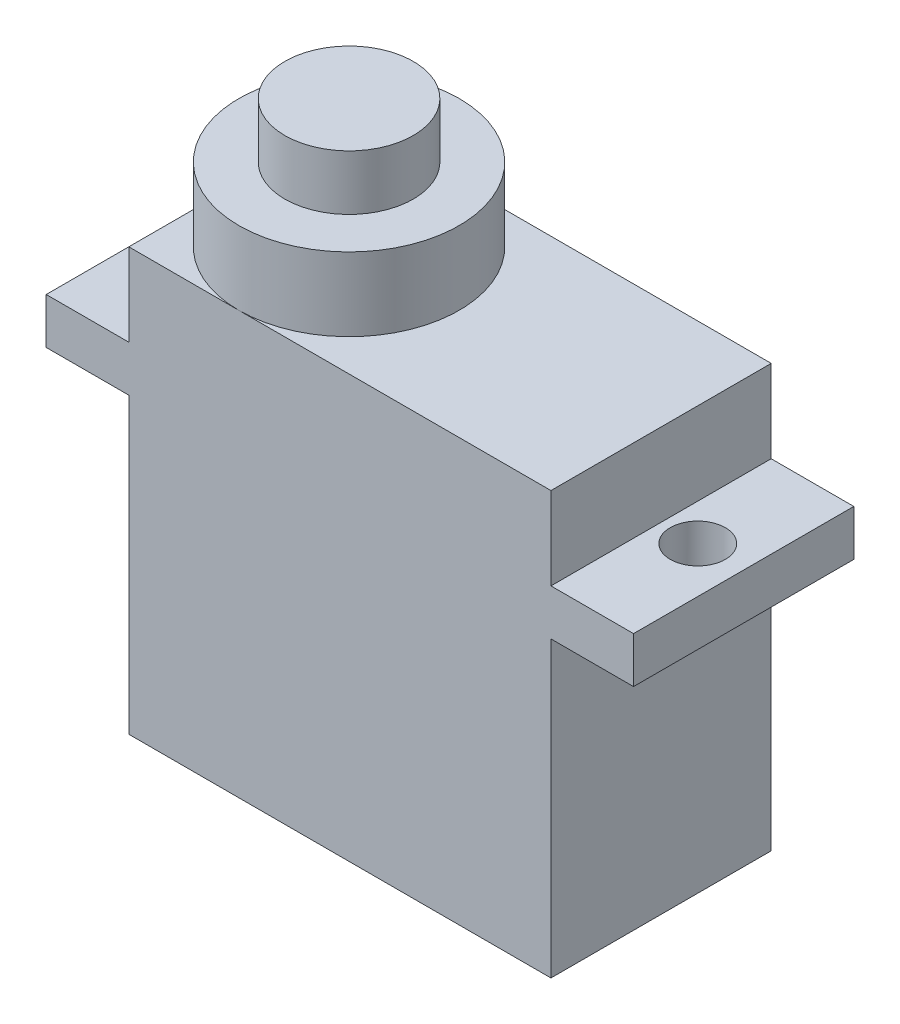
from build123d import *

# Parameters (mm, degrees)
SKETCH1_W           = 32
SKETCH1_H           = 12
BOSS_EXTRUDE1_DEPTH = 23
SKETCH2_W           = 4.5
SKETCH2_H           = 16
SKETCH2_H_2         = 4.5
CUT_EXTRUDE1_DEPTH  = 23
SKETCH3_R           = 1.5
CUT_EXTRUDE2_DEPTH  = 23
SKETCH4_R           = 6
BOSS_EXTRUDE2_DEPTH = 4
SKETCH5_R           = 3.5
BOSS_EXTRUDE3_DEPTH = 3


with BuildPart() as part:
    # Sketch1 → Boss-Extrude1 (new body)
    with BuildSketch(Plane(origin=(0, 0, 0), x_dir=(1, 0, 0), z_dir=(0, 1, 0))):
        with Locations((16, 6)):
            Rectangle(SKETCH1_W, SKETCH1_H)
    extrude(amount=BOSS_EXTRUDE1_DEPTH)

    # Sketch2 → Cut-Extrude1 (cut)
    with BuildSketch(Plane.XY):
        with Locations((2.25, 8)):
            Rectangle(SKETCH2_W, SKETCH2_H)
        with Locations((2.25, 20.75)):
            Rectangle(SKETCH2_W, SKETCH2_H_2)
        with Locations((29.75, 20.75)):
            Rectangle(SKETCH2_W, SKETCH2_H_2)
        with Locations((29.75, 8)):
            Rectangle(SKETCH2_W, SKETCH2_H)
    extrude(amount=-CUT_EXTRUDE1_DEPTH, mode=Mode.SUBTRACT)

    # Sketch3 → Cut-Extrude2 (cut)
    with BuildSketch(Plane(origin=(0, 18.5, 0), x_dir=(1, 0, 0), z_dir=(0, 1, 0))):
        with Locations(Location((2.5, 6, 0), (0, 0, 270))):
            Circle(SKETCH3_R)
        with Locations(Location((29.5, 6, 0), (0, 0, 270))):
            Circle(SKETCH3_R)
    extrude(amount=-CUT_EXTRUDE2_DEPTH, mode=Mode.SUBTRACT)

    # Sketch4 → Boss-Extrude2 (add)
    with BuildSketch(Plane(origin=(0, 23, 0), x_dir=(1, 0, 0), z_dir=(0, 1, 0))):
        with Locations(Location((10.5, 6, 0), (0, 0, 270))):
            Circle(SKETCH4_R)
    extrude(amount=BOSS_EXTRUDE2_DEPTH)

    # Sketch5 → Boss-Extrude3 (add)
    with BuildSketch(Plane(origin=(0, 27, 0), x_dir=(1, 0, 0), z_dir=(0, 1, 0))):
        with Locations(Location((10.5, 6, 0), (0, 0, 270))):
            Circle(SKETCH5_R)
    extrude(amount=BOSS_EXTRUDE3_DEPTH)


solid = part.part
